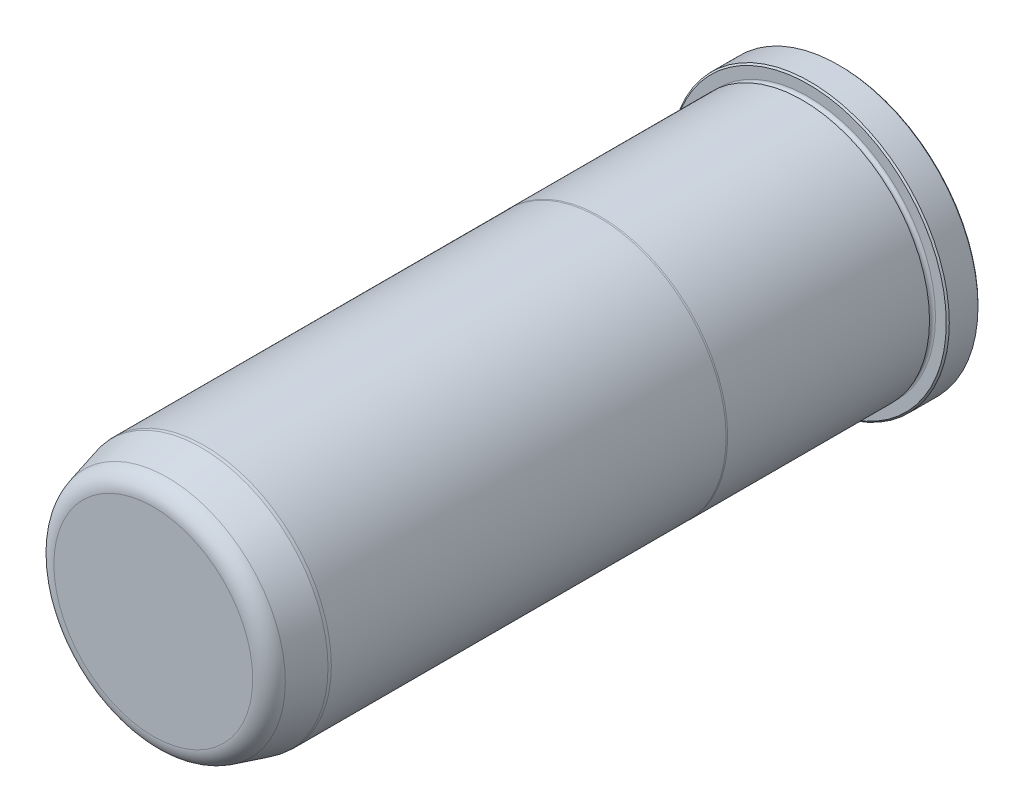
ISO-10303-21;
HEADER;
FILE_DESCRIPTION(('STEP AP214'),'2;1');
FILE_NAME('part.step','',(''),(''),'','','');
FILE_SCHEMA(('AUTOMOTIVE_DESIGN { 1 0 10303 214 1 1 1 1 }'));
ENDSEC;
DATA;
#1=APPLICATION_CONTEXT('core data for automotive mechanical design processes');
#2=APPLICATION_PROTOCOL_DEFINITION('international standard','automotive_design',2000,#1);
#3=PRODUCT_CONTEXT('',#1,'mechanical');
#4=PRODUCT('Part','Part','',(#3));
#5=PRODUCT_RELATED_PRODUCT_CATEGORY('part','',(#4));
#6=PRODUCT_DEFINITION_FORMATION('','',#4);
#7=PRODUCT_DEFINITION_CONTEXT('part definition',#1,'design');
#8=PRODUCT_DEFINITION('design','',#6,#7);
#9=PRODUCT_DEFINITION_SHAPE('','',#8);
#10=(LENGTH_UNIT() NAMED_UNIT(*) SI_UNIT(.MILLI.,.METRE.));
#11=(NAMED_UNIT(*) PLANE_ANGLE_UNIT() SI_UNIT($,.RADIAN.));
#12=(NAMED_UNIT(*) SI_UNIT($,.STERADIAN.) SOLID_ANGLE_UNIT());
#13=UNCERTAINTY_MEASURE_WITH_UNIT(LENGTH_MEASURE(1.E-05),#10,'distance_accuracy_value','');
#14=(GEOMETRIC_REPRESENTATION_CONTEXT(3) GLOBAL_UNCERTAINTY_ASSIGNED_CONTEXT((#13)) GLOBAL_UNIT_ASSIGNED_CONTEXT((#10,
#11,#12)) REPRESENTATION_CONTEXT('',''));
#15=CARTESIAN_POINT('',(0.,0.,0.));
#16=DIRECTION('',(0.,0.,1.));
#17=DIRECTION('',(1.,0.,0.));
#18=AXIS2_PLACEMENT_3D('',#15,#16,#17);
#19=CARTESIAN_POINT('',(0.,0.,0.));
#20=DIRECTION('',(0.,0.,1.));
#21=DIRECTION('',(1.,0.,0.));
#22=AXIS2_PLACEMENT_3D('',#19,#20,#21);
#23=PLANE('',#22);
#24=CARTESIAN_POINT('',(0.,0.,0.));
#25=DIRECTION('',(0.,0.,1.));
#26=DIRECTION('',(1.,0.,0.));
#27=AXIS2_PLACEMENT_3D('',#24,#25,#26);
#28=CIRCLE('',#27,34.417);
#29=CARTESIAN_POINT('',(34.417,0.,0.));
#30=VERTEX_POINT('',#29);
#31=EDGE_CURVE('E37',#30,#30,#28,.F.);
#32=ORIENTED_EDGE('',*,*,#31,.T.);
#33=EDGE_LOOP('',(#32));
#34=FACE_BOUND('',#33,.T.);
#35=ADVANCED_FACE('F30',(#34),#23,.F.);
#36=CARTESIAN_POINT('',(0.,0.,0.));
#37=DIRECTION('',(0.,0.,1.));
#38=DIRECTION('',(1.,0.,0.));
#39=AXIS2_PLACEMENT_3D('',#36,#37,#38);
#40=CYLINDRICAL_SURFACE('',#39,34.798);
#41=CARTESIAN_POINT('',(0.,0.,0.380999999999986));
#42=DIRECTION('',(0.,0.,1.));
#43=DIRECTION('',(1.,0.,0.));
#44=AXIS2_PLACEMENT_3D('',#41,#42,#43);
#45=CIRCLE('',#44,34.798);
#46=CARTESIAN_POINT('',(34.798,0.,0.380999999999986));
#47=VERTEX_POINT('',#46);
#48=EDGE_CURVE('E41',#47,#47,#45,.T.);
#49=ORIENTED_EDGE('',*,*,#48,.T.);
#50=EDGE_LOOP('',(#49));
#51=FACE_BOUND('',#50,.T.);
#52=CARTESIAN_POINT('',(0.,0.,7.54379999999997));
#53=DIRECTION('',(0.,0.,-1.));
#54=DIRECTION('',(-1.,0.,0.));
#55=AXIS2_PLACEMENT_3D('',#52,#53,#54);
#56=CIRCLE('',#55,34.798);
#57=CARTESIAN_POINT('',(-34.798,0.,7.54379999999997));
#58=VERTEX_POINT('',#57);
#59=EDGE_CURVE('E45',#58,#58,#56,.T.);
#60=ORIENTED_EDGE('',*,*,#59,.T.);
#61=EDGE_LOOP('',(#60));
#62=FACE_BOUND('',#61,.T.);
#63=ADVANCED_FACE('F118',(#51,#62),#40,.T.);
#64=CARTESIAN_POINT('',(0.,34.798,7.9248));
#65=DIRECTION('',(0.,0.,-1.));
#66=DIRECTION('',(-1.,0.,0.));
#67=AXIS2_PLACEMENT_3D('',#64,#65,#66);
#68=PLANE('',#67);
#69=CARTESIAN_POINT('',(0.,0.,7.9248));
#70=DIRECTION('',(0.,0.,-1.));
#71=DIRECTION('',(-1.,0.,0.));
#72=AXIS2_PLACEMENT_3D('',#69,#70,#71);
#73=CIRCLE('',#72,34.417);
#74=CARTESIAN_POINT('',(-34.417,0.,7.9248));
#75=VERTEX_POINT('',#74);
#76=EDGE_CURVE('E10',#75,#75,#73,.F.);
#77=ORIENTED_EDGE('',*,*,#76,.T.);
#78=EDGE_LOOP('',(#77));
#79=FACE_BOUND('',#78,.T.);
#80=CARTESIAN_POINT('',(0.,0.,7.9248));
#81=DIRECTION('',(0.,0.,1.));
#82=DIRECTION('',(1.,0.,0.));
#83=AXIS2_PLACEMENT_3D('',#80,#81,#82);
#84=CIRCLE('',#83,31.7373);
#85=CARTESIAN_POINT('',(31.7373,0.,7.9248));
#86=VERTEX_POINT('',#85);
#87=EDGE_CURVE('E56',#86,#86,#84,.T.);
#88=ORIENTED_EDGE('',*,*,#87,.F.);
#89=EDGE_LOOP('',(#88));
#90=FACE_BOUND('',#89,.T.);
#91=ADVANCED_FACE('F113',(#79,#90),#68,.F.);
#92=CARTESIAN_POINT('',(0.,0.,8.6868));
#93=DIRECTION('',(0.,0.,1.));
#94=DIRECTION('',(1.,0.,0.));
#95=AXIS2_PLACEMENT_3D('',#92,#93,#94);
#96=TOROIDAL_SURFACE('',#95,31.7373,0.761999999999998);
#97=CARTESIAN_POINT('',(0.,0.,9.44879999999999));
#98=DIRECTION('',(0.,0.,1.));
#99=DIRECTION('',(1.,0.,0.));
#100=AXIS2_PLACEMENT_3D('',#97,#98,#99);
#101=CIRCLE('',#100,31.7373);
#102=CARTESIAN_POINT('',(31.7373,0.,9.44879999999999));
#103=VERTEX_POINT('',#102);
#104=EDGE_CURVE('E59',#103,#103,#101,.T.);
#105=ORIENTED_EDGE('',*,*,#104,.F.);
#106=EDGE_LOOP('',(#105));
#107=FACE_BOUND('',#106,.T.);
#108=ORIENTED_EDGE('',*,*,#87,.T.);
#109=EDGE_LOOP('',(#108));
#110=FACE_BOUND('',#109,.T.);
#111=ADVANCED_FACE('F107',(#107,#110),#96,.F.);
#112=CARTESIAN_POINT('',(0.,31.7373,9.44879999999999));
#113=DIRECTION('',(0.,0.,1.));
#114=DIRECTION('',(1.,0.,0.));
#115=AXIS2_PLACEMENT_3D('',#112,#113,#114);
#116=PLANE('',#115);
#117=CARTESIAN_POINT('',(0.,0.,9.4488));
#118=DIRECTION('',(0.,0.,1.));
#119=DIRECTION('',(1.,0.,0.));
#120=AXIS2_PLACEMENT_3D('',#117,#118,#119);
#121=CIRCLE('',#120,31.7627);
#122=CARTESIAN_POINT('',(31.7627,0.,9.4488));
#123=VERTEX_POINT('',#122);
#124=EDGE_CURVE('E62',#123,#123,#121,.T.);
#125=ORIENTED_EDGE('',*,*,#124,.F.);
#126=EDGE_LOOP('',(#125));
#127=FACE_BOUND('',#126,.T.);
#128=ORIENTED_EDGE('',*,*,#104,.T.);
#129=EDGE_LOOP('',(#128));
#130=FACE_BOUND('',#129,.T.);
#131=ADVANCED_FACE('F101',(#127,#130),#116,.F.);
#132=CARTESIAN_POINT('',(0.,0.,0.));
#133=DIRECTION('',(0.,0.,1.));
#134=DIRECTION('',(1.,0.,0.));
#135=AXIS2_PLACEMENT_3D('',#132,#133,#134);
#136=CYLINDRICAL_SURFACE('',#135,31.7627);
#137=CARTESIAN_POINT('',(0.,0.,59.8347630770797));
#138=DIRECTION('',(0.,0.,1.));
#139=DIRECTION('',(1.,0.,0.));
#140=AXIS2_PLACEMENT_3D('',#137,#138,#139);
#141=CIRCLE('',#140,31.7627);
#142=CARTESIAN_POINT('',(31.7627,0.,59.8347630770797));
#143=VERTEX_POINT('',#142);
#144=EDGE_CURVE('E65',#143,#143,#141,.T.);
#145=ORIENTED_EDGE('',*,*,#144,.F.);
#146=EDGE_LOOP('',(#145));
#147=FACE_BOUND('',#146,.T.);
#148=ORIENTED_EDGE('',*,*,#124,.T.);
#149=EDGE_LOOP('',(#148));
#150=FACE_BOUND('',#149,.T.);
#151=ADVANCED_FACE('F95',(#147,#150),#136,.T.);
#152=CARTESIAN_POINT('',(0.,0.,59.8347630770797));
#153=DIRECTION('',(0.,0.,-1.));
#154=DIRECTION('',(-1.,0.,0.));
#155=AXIS2_PLACEMENT_3D('',#152,#153,#154);
#156=CONICAL_SURFACE('',#155,31.7627,0.0698131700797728);
#157=CARTESIAN_POINT('',(0.,0.,60.198));
#158=DIRECTION('',(0.,0.,1.));
#159=DIRECTION('',(1.,0.,0.));
#160=AXIS2_PLACEMENT_3D('',#157,#158,#159);
#161=CIRCLE('',#160,31.7373);
#162=CARTESIAN_POINT('',(31.7373,0.,60.198));
#163=VERTEX_POINT('',#162);
#164=EDGE_CURVE('E68',#163,#163,#161,.T.);
#165=ORIENTED_EDGE('',*,*,#164,.F.);
#166=EDGE_LOOP('',(#165));
#167=FACE_BOUND('',#166,.T.);
#168=ORIENTED_EDGE('',*,*,#144,.T.);
#169=EDGE_LOOP('',(#168));
#170=FACE_BOUND('',#169,.T.);
#171=ADVANCED_FACE('F89',(#167,#170),#156,.T.);
#172=CARTESIAN_POINT('',(0.,0.,0.));
#173=DIRECTION('',(0.,0.,1.));
#174=DIRECTION('',(1.,0.,0.));
#175=AXIS2_PLACEMENT_3D('',#172,#173,#174);
#176=CYLINDRICAL_SURFACE('',#175,31.7373);
#177=CARTESIAN_POINT('',(0.,0.,158.75));
#178=DIRECTION('',(0.,0.,1.));
#179=DIRECTION('',(1.,0.,0.));
#180=AXIS2_PLACEMENT_3D('',#177,#178,#179);
#181=CIRCLE('',#180,31.7373);
#182=CARTESIAN_POINT('',(31.7373,0.,158.75));
#183=VERTEX_POINT('',#182);
#184=EDGE_CURVE('E71',#183,#183,#181,.T.);
#185=ORIENTED_EDGE('',*,*,#184,.F.);
#186=EDGE_LOOP('',(#185));
#187=FACE_BOUND('',#186,.T.);
#188=ORIENTED_EDGE('',*,*,#164,.T.);
#189=EDGE_LOOP('',(#188));
#190=FACE_BOUND('',#189,.T.);
#191=ADVANCED_FACE('F83',(#187,#190),#176,.T.);
#192=CARTESIAN_POINT('',(0.,0.,158.75));
#193=DIRECTION('',(0.,0.,-1.));
#194=DIRECTION('',(-1.,0.,0.));
#195=AXIS2_PLACEMENT_3D('',#192,#193,#194);
#196=CONICAL_SURFACE('',#195,31.7373,0.0872664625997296);
#197=CARTESIAN_POINT('',(0.,0.,159.512));
#198=DIRECTION('',(0.,0.,1.));
#199=DIRECTION('',(1.,0.,0.));
#200=AXIS2_PLACEMENT_3D('',#197,#198,#199);
#201=CIRCLE('',#200,31.6706336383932);
#202=CARTESIAN_POINT('',(31.6706336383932,0.,159.512));
#203=VERTEX_POINT('',#202);
#204=EDGE_CURVE('E74',#203,#203,#201,.T.);
#205=ORIENTED_EDGE('',*,*,#204,.F.);
#206=EDGE_LOOP('',(#205));
#207=FACE_BOUND('',#206,.T.);
#208=ORIENTED_EDGE('',*,*,#184,.T.);
#209=EDGE_LOOP('',(#208));
#210=FACE_BOUND('',#209,.T.);
#211=ADVANCED_FACE('F80',(#207,#210),#196,.T.);
#212=CARTESIAN_POINT('',(0.,0.,159.512));
#213=DIRECTION('',(0.,0.,-1.));
#214=DIRECTION('',(-1.,0.,0.));
#215=AXIS2_PLACEMENT_3D('',#212,#213,#214);
#216=CONICAL_SURFACE('',#215,31.6706336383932,0.26179938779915);
#217=CARTESIAN_POINT('',(0.,0.,167.920125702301));
#218=DIRECTION('',(0.,0.,1.));
#219=DIRECTION('',(1.,0.,0.));
#220=AXIS2_PLACEMENT_3D('',#217,#218,#219);
#221=CIRCLE('',#220,29.4176831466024);
#222=CARTESIAN_POINT('',(29.4176831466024,0.,167.920125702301));
#223=VERTEX_POINT('',#222);
#224=EDGE_CURVE('E50',#223,#223,#221,.F.);
#225=ORIENTED_EDGE('',*,*,#224,.T.);
#226=EDGE_LOOP('',(#225));
#227=FACE_BOUND('',#226,.T.);
#228=ORIENTED_EDGE('',*,*,#204,.T.);
#229=EDGE_LOOP('',(#228));
#230=FACE_BOUND('',#229,.T.);
#231=ADVANCED_FACE('F78',(#227,#230),#216,.T.);
#232=CARTESIAN_POINT('',(0.,28.4718561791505,171.45));
#233=DIRECTION('',(0.,0.,-1.));
#234=DIRECTION('',(-1.,0.,0.));
#235=AXIS2_PLACEMENT_3D('',#232,#233,#234);
#236=PLANE('',#235);
#237=CARTESIAN_POINT('',(0.,0.,171.45));
#238=DIRECTION('',(0.,0.,-1.));
#239=DIRECTION('',(-1.,0.,0.));
#240=AXIS2_PLACEMENT_3D('',#237,#238,#239);
#241=CIRCLE('',#240,24.8174613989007);
#242=CARTESIAN_POINT('',(-24.8174613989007,0.,171.45));
#243=VERTEX_POINT('',#242);
#244=EDGE_CURVE('E53',#243,#243,#241,.F.);
#245=ORIENTED_EDGE('',*,*,#244,.T.);
#246=EDGE_LOOP('',(#245));
#247=FACE_BOUND('',#246,.T.);
#248=ADVANCED_FACE('F133',(#247),#236,.F.);
#249=CARTESIAN_POINT('',(0.,0.,166.6875));
#250=DIRECTION('',(0.,0.,-1.));
#251=DIRECTION('',(-1.,0.,0.));
#252=AXIS2_PLACEMENT_3D('',#249,#250,#251);
#253=TOROIDAL_SURFACE('',#252,24.8174613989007,4.7625);
#254=ORIENTED_EDGE('',*,*,#224,.F.);
#255=EDGE_LOOP('',(#254));
#256=FACE_BOUND('',#255,.T.);
#257=ORIENTED_EDGE('',*,*,#244,.F.);
#258=EDGE_LOOP('',(#257));
#259=FACE_BOUND('',#258,.T.);
#260=ADVANCED_FACE('F130',(#256,#259),#253,.T.);
#261=CARTESIAN_POINT('',(0.,0.,0.380999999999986));
#262=DIRECTION('',(0.,0.,1.));
#263=DIRECTION('',(1.,0.,0.));
#264=AXIS2_PLACEMENT_3D('',#261,#262,#263);
#265=CONICAL_SURFACE('',#264,34.798,0.785398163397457);
#266=ORIENTED_EDGE('',*,*,#31,.F.);
#267=EDGE_LOOP('',(#266));
#268=FACE_BOUND('',#267,.T.);
#269=ORIENTED_EDGE('',*,*,#48,.F.);
#270=EDGE_LOOP('',(#269));
#271=FACE_BOUND('',#270,.T.);
#272=ADVANCED_FACE('F132',(#268,#271),#265,.T.);
#273=CARTESIAN_POINT('',(0.,0.,7.9248));
#274=DIRECTION('',(0.,0.,-1.));
#275=DIRECTION('',(-1.,0.,0.));
#276=AXIS2_PLACEMENT_3D('',#273,#274,#275);
#277=CONICAL_SURFACE('',#276,34.417,0.785398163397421);
#278=ORIENTED_EDGE('',*,*,#59,.F.);
#279=EDGE_LOOP('',(#278));
#280=FACE_BOUND('',#279,.T.);
#281=ORIENTED_EDGE('',*,*,#76,.F.);
#282=EDGE_LOOP('',(#281));
#283=FACE_BOUND('',#282,.T.);
#284=ADVANCED_FACE('F32',(#280,#283),#277,.T.);
#285=CLOSED_SHELL('',(#35,#63,#91,#111,#131,#151,#171,#191,#211,#231,#248,#260,#272,#284));
#286=MANIFOLD_SOLID_BREP('B2',#285);
#287=ADVANCED_BREP_SHAPE_REPRESENTATION('',(#18,#286),#14);
#288=SHAPE_DEFINITION_REPRESENTATION(#9,#287);
ENDSEC;
END-ISO-10303-21;
